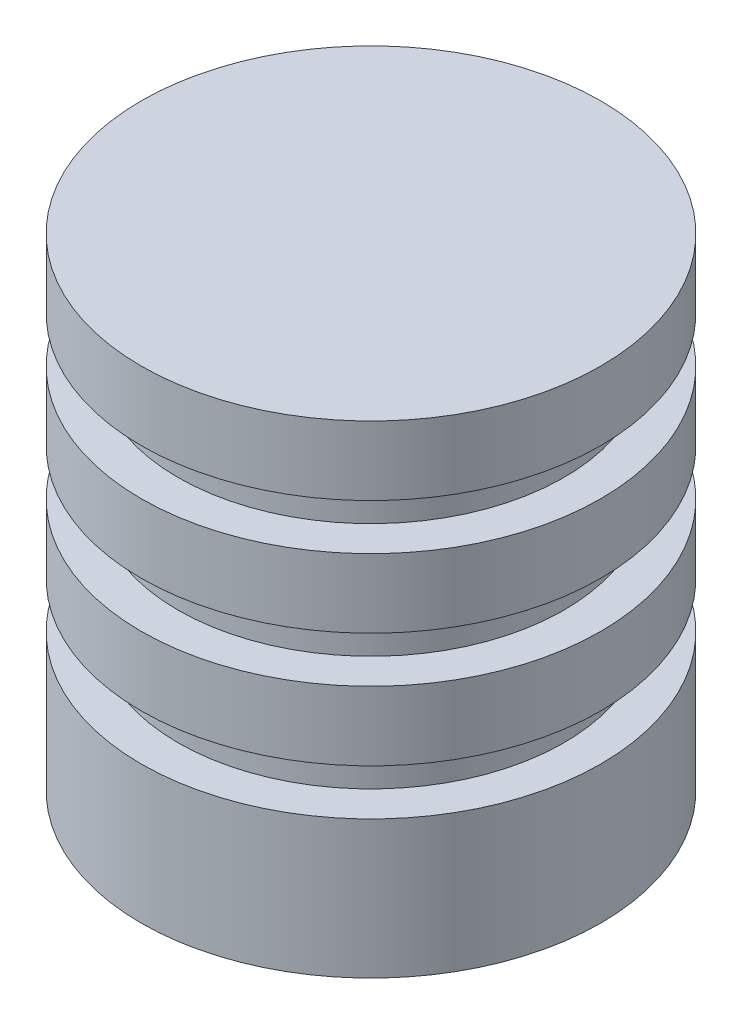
ISO-10303-21;
HEADER;
FILE_DESCRIPTION(('STEP AP214'),'2;1');
FILE_NAME('part.step','',(''),(''),'','','');
FILE_SCHEMA(('AUTOMOTIVE_DESIGN { 1 0 10303 214 1 1 1 1 }'));
ENDSEC;
DATA;
#1=APPLICATION_CONTEXT('core data for automotive mechanical design processes');
#2=APPLICATION_PROTOCOL_DEFINITION('international standard','automotive_design',2000,#1);
#3=PRODUCT_CONTEXT('',#1,'mechanical');
#4=PRODUCT('Part','Part','',(#3));
#5=PRODUCT_RELATED_PRODUCT_CATEGORY('part','',(#4));
#6=PRODUCT_DEFINITION_FORMATION('','',#4);
#7=PRODUCT_DEFINITION_CONTEXT('part definition',#1,'design');
#8=PRODUCT_DEFINITION('design','',#6,#7);
#9=PRODUCT_DEFINITION_SHAPE('','',#8);
#10=(LENGTH_UNIT() NAMED_UNIT(*) SI_UNIT(.MILLI.,.METRE.));
#11=(NAMED_UNIT(*) PLANE_ANGLE_UNIT() SI_UNIT($,.RADIAN.));
#12=(NAMED_UNIT(*) SI_UNIT($,.STERADIAN.) SOLID_ANGLE_UNIT());
#13=UNCERTAINTY_MEASURE_WITH_UNIT(LENGTH_MEASURE(1.E-05),#10,'distance_accuracy_value','');
#14=(GEOMETRIC_REPRESENTATION_CONTEXT(3) GLOBAL_UNCERTAINTY_ASSIGNED_CONTEXT((#13)) GLOBAL_UNIT_ASSIGNED_CONTEXT((#10,
#11,#12)) REPRESENTATION_CONTEXT('',''));
#15=CARTESIAN_POINT('',(0.,0.,0.));
#16=DIRECTION('',(0.,0.,1.));
#17=DIRECTION('',(1.,0.,0.));
#18=AXIS2_PLACEMENT_3D('',#15,#16,#17);
#19=CARTESIAN_POINT('',(0.,0.,0.));
#20=DIRECTION('',(0.,-1.,0.));
#21=DIRECTION('',(0.,0.,-1.));
#22=AXIS2_PLACEMENT_3D('',#19,#20,#21);
#23=CYLINDRICAL_SURFACE('',#22,50.);
#24=CARTESIAN_POINT('',(0.,65.,0.));
#25=DIRECTION('',(0.,1.,0.));
#26=DIRECTION('',(0.,0.,1.));
#27=AXIS2_PLACEMENT_3D('',#24,#25,#26);
#28=CIRCLE('',#27,50.);
#29=CARTESIAN_POINT('',(0.,65.,50.));
#30=VERTEX_POINT('',#29);
#31=EDGE_CURVE('E69',#30,#30,#28,.F.);
#32=ORIENTED_EDGE('',*,*,#31,.F.);
#33=EDGE_LOOP('',(#32));
#34=FACE_BOUND('',#33,.T.);
#35=CARTESIAN_POINT('',(0.,80.,0.));
#36=DIRECTION('',(0.,1.,0.));
#37=DIRECTION('',(0.,0.,1.));
#38=AXIS2_PLACEMENT_3D('',#35,#36,#37);
#39=CIRCLE('',#38,50.);
#40=CARTESIAN_POINT('',(0.,80.,50.));
#41=VERTEX_POINT('',#40);
#42=EDGE_CURVE('E58',#41,#41,#39,.F.);
#43=ORIENTED_EDGE('',*,*,#42,.T.);
#44=EDGE_LOOP('',(#43));
#45=FACE_BOUND('',#44,.T.);
#46=ADVANCED_FACE('F38',(#34,#45),#23,.T.);
#47=CARTESIAN_POINT('',(0.,80.,0.));
#48=DIRECTION('',(0.,1.,0.));
#49=DIRECTION('',(0.,0.,1.));
#50=AXIS2_PLACEMENT_3D('',#47,#48,#49);
#51=PLANE('',#50);
#52=ORIENTED_EDGE('',*,*,#42,.F.);
#53=EDGE_LOOP('',(#52));
#54=FACE_BOUND('',#53,.T.);
#55=CARTESIAN_POINT('',(0.,80.,0.));
#56=DIRECTION('',(0.,1.,0.));
#57=DIRECTION('',(0.,0.,1.));
#58=AXIS2_PLACEMENT_3D('',#55,#56,#57);
#59=CIRCLE('',#58,42.);
#60=CARTESIAN_POINT('',(0.,80.,42.));
#61=VERTEX_POINT('',#60);
#62=EDGE_CURVE('E59',#61,#61,#59,.T.);
#63=ORIENTED_EDGE('',*,*,#62,.F.);
#64=EDGE_LOOP('',(#63));
#65=FACE_BOUND('',#64,.T.);
#66=ADVANCED_FACE('F111',(#54,#65),#51,.T.);
#67=CARTESIAN_POINT('',(0.,90.,0.));
#68=DIRECTION('',(0.,1.,0.));
#69=DIRECTION('',(0.,0.,1.));
#70=AXIS2_PLACEMENT_3D('',#67,#68,#69);
#71=PLANE('',#70);
#72=CARTESIAN_POINT('',(0.,90.,0.));
#73=DIRECTION('',(0.,1.,0.));
#74=DIRECTION('',(0.,0.,1.));
#75=AXIS2_PLACEMENT_3D('',#72,#73,#74);
#76=CIRCLE('',#75,50.);
#77=CARTESIAN_POINT('',(0.,90.,50.));
#78=VERTEX_POINT('',#77);
#79=EDGE_CURVE('E55',#78,#78,#76,.F.);
#80=ORIENTED_EDGE('',*,*,#79,.T.);
#81=EDGE_LOOP('',(#80));
#82=FACE_BOUND('',#81,.T.);
#83=CARTESIAN_POINT('',(0.,90.,0.));
#84=DIRECTION('',(0.,1.,0.));
#85=DIRECTION('',(0.,0.,1.));
#86=AXIS2_PLACEMENT_3D('',#83,#84,#85);
#87=CIRCLE('',#86,42.);
#88=CARTESIAN_POINT('',(0.,90.,42.));
#89=VERTEX_POINT('',#88);
#90=EDGE_CURVE('E74',#89,#89,#87,.T.);
#91=ORIENTED_EDGE('',*,*,#90,.T.);
#92=EDGE_LOOP('',(#91));
#93=FACE_BOUND('',#92,.T.);
#94=ADVANCED_FACE('F119',(#82,#93),#71,.F.);
#95=CARTESIAN_POINT('',(0.,80.,0.));
#96=DIRECTION('',(0.,1.,0.));
#97=DIRECTION('',(0.,0.,1.));
#98=AXIS2_PLACEMENT_3D('',#95,#96,#97);
#99=CYLINDRICAL_SURFACE('',#98,42.);
#100=ORIENTED_EDGE('',*,*,#62,.T.);
#101=EDGE_LOOP('',(#100));
#102=FACE_BOUND('',#101,.T.);
#103=ORIENTED_EDGE('',*,*,#90,.F.);
#104=EDGE_LOOP('',(#103));
#105=FACE_BOUND('',#104,.T.);
#106=ADVANCED_FACE('F133',(#102,#105),#99,.T.);
#107=CARTESIAN_POINT('',(0.,105.,0.));
#108=DIRECTION('',(0.,1.,0.));
#109=DIRECTION('',(0.,0.,1.));
#110=AXIS2_PLACEMENT_3D('',#107,#108,#109);
#111=PLANE('',#110);
#112=CARTESIAN_POINT('',(0.,105.,0.));
#113=DIRECTION('',(0.,-1.,0.));
#114=DIRECTION('',(0.,0.,-1.));
#115=AXIS2_PLACEMENT_3D('',#112,#113,#114);
#116=CIRCLE('',#115,50.);
#117=CARTESIAN_POINT('',(0.,105.,-50.));
#118=VERTEX_POINT('',#117);
#119=EDGE_CURVE('E11',#118,#118,#116,.T.);
#120=ORIENTED_EDGE('',*,*,#119,.F.);
#121=EDGE_LOOP('',(#120));
#122=FACE_BOUND('',#121,.T.);
#123=ADVANCED_FACE('F124',(#122),#111,.T.);
#124=ORIENTED_EDGE('',*,*,#79,.F.);
#125=EDGE_LOOP('',(#124));
#126=FACE_BOUND('',#125,.T.);
#127=ORIENTED_EDGE('',*,*,#119,.T.);
#128=EDGE_LOOP('',(#127));
#129=FACE_BOUND('',#128,.T.);
#130=ADVANCED_FACE('F113',(#126,#129),#23,.T.);
#131=CARTESIAN_POINT('',(0.,55.,0.));
#132=DIRECTION('',(0.,1.,0.));
#133=DIRECTION('',(0.,0.,1.));
#134=AXIS2_PLACEMENT_3D('',#131,#132,#133);
#135=PLANE('',#134);
#136=CARTESIAN_POINT('',(0.,55.,0.));
#137=DIRECTION('',(0.,1.,0.));
#138=DIRECTION('',(0.,0.,1.));
#139=AXIS2_PLACEMENT_3D('',#136,#137,#138);
#140=CIRCLE('',#139,50.);
#141=CARTESIAN_POINT('',(0.,55.,50.));
#142=VERTEX_POINT('',#141);
#143=EDGE_CURVE('E42',#142,#142,#140,.F.);
#144=ORIENTED_EDGE('',*,*,#143,.F.);
#145=EDGE_LOOP('',(#144));
#146=FACE_BOUND('',#145,.T.);
#147=CARTESIAN_POINT('',(0.,55.,0.));
#148=DIRECTION('',(0.,1.,0.));
#149=DIRECTION('',(0.,0.,1.));
#150=AXIS2_PLACEMENT_3D('',#147,#148,#149);
#151=CIRCLE('',#150,42.);
#152=CARTESIAN_POINT('',(0.,55.,42.));
#153=VERTEX_POINT('',#152);
#154=EDGE_CURVE('E67',#153,#153,#151,.T.);
#155=ORIENTED_EDGE('',*,*,#154,.F.);
#156=EDGE_LOOP('',(#155));
#157=FACE_BOUND('',#156,.T.);
#158=ADVANCED_FACE('F123',(#146,#157),#135,.T.);
#159=CARTESIAN_POINT('',(0.,65.,0.));
#160=DIRECTION('',(0.,1.,0.));
#161=DIRECTION('',(0.,0.,1.));
#162=AXIS2_PLACEMENT_3D('',#159,#160,#161);
#163=PLANE('',#162);
#164=ORIENTED_EDGE('',*,*,#31,.T.);
#165=EDGE_LOOP('',(#164));
#166=FACE_BOUND('',#165,.T.);
#167=CARTESIAN_POINT('',(0.,65.,0.));
#168=DIRECTION('',(0.,1.,0.));
#169=DIRECTION('',(0.,0.,1.));
#170=AXIS2_PLACEMENT_3D('',#167,#168,#169);
#171=CIRCLE('',#170,42.);
#172=CARTESIAN_POINT('',(0.,65.,42.));
#173=VERTEX_POINT('',#172);
#174=EDGE_CURVE('E163',#173,#173,#171,.T.);
#175=ORIENTED_EDGE('',*,*,#174,.T.);
#176=EDGE_LOOP('',(#175));
#177=FACE_BOUND('',#176,.T.);
#178=ADVANCED_FACE('F129',(#166,#177),#163,.F.);
#179=CARTESIAN_POINT('',(0.,55.,0.));
#180=DIRECTION('',(0.,1.,0.));
#181=DIRECTION('',(0.,0.,1.));
#182=AXIS2_PLACEMENT_3D('',#179,#180,#181);
#183=CYLINDRICAL_SURFACE('',#182,42.);
#184=ORIENTED_EDGE('',*,*,#154,.T.);
#185=EDGE_LOOP('',(#184));
#186=FACE_BOUND('',#185,.T.);
#187=ORIENTED_EDGE('',*,*,#174,.F.);
#188=EDGE_LOOP('',(#187));
#189=FACE_BOUND('',#188,.T.);
#190=ADVANCED_FACE('F138',(#186,#189),#183,.T.);
#191=CARTESIAN_POINT('',(0.,40.,0.));
#192=DIRECTION('',(0.,1.,0.));
#193=DIRECTION('',(0.,0.,1.));
#194=AXIS2_PLACEMENT_3D('',#191,#192,#193);
#195=CIRCLE('',#194,50.);
#196=CARTESIAN_POINT('',(0.,40.,50.));
#197=VERTEX_POINT('',#196);
#198=EDGE_CURVE('E63',#197,#197,#195,.F.);
#199=ORIENTED_EDGE('',*,*,#198,.F.);
#200=EDGE_LOOP('',(#199));
#201=FACE_BOUND('',#200,.T.);
#202=ORIENTED_EDGE('',*,*,#143,.T.);
#203=EDGE_LOOP('',(#202));
#204=FACE_BOUND('',#203,.T.);
#205=ADVANCED_FACE('F107',(#201,#204),#23,.T.);
#206=CARTESIAN_POINT('',(0.,30.,0.));
#207=DIRECTION('',(0.,1.,0.));
#208=DIRECTION('',(0.,0.,1.));
#209=AXIS2_PLACEMENT_3D('',#206,#207,#208);
#210=PLANE('',#209);
#211=CARTESIAN_POINT('',(0.,30.,0.));
#212=DIRECTION('',(0.,1.,0.));
#213=DIRECTION('',(0.,0.,1.));
#214=AXIS2_PLACEMENT_3D('',#211,#212,#213);
#215=CIRCLE('',#214,50.);
#216=CARTESIAN_POINT('',(0.,30.,50.));
#217=VERTEX_POINT('',#216);
#218=EDGE_CURVE('E66',#217,#217,#215,.F.);
#219=ORIENTED_EDGE('',*,*,#218,.F.);
#220=EDGE_LOOP('',(#219));
#221=FACE_BOUND('',#220,.T.);
#222=CARTESIAN_POINT('',(0.,30.,0.));
#223=DIRECTION('',(0.,1.,0.));
#224=DIRECTION('',(0.,0.,1.));
#225=AXIS2_PLACEMENT_3D('',#222,#223,#224);
#226=CIRCLE('',#225,42.);
#227=CARTESIAN_POINT('',(0.,30.,42.));
#228=VERTEX_POINT('',#227);
#229=EDGE_CURVE('E161',#228,#228,#226,.T.);
#230=ORIENTED_EDGE('',*,*,#229,.F.);
#231=EDGE_LOOP('',(#230));
#232=FACE_BOUND('',#231,.T.);
#233=ADVANCED_FACE('F137',(#221,#232),#210,.T.);
#234=CARTESIAN_POINT('',(0.,40.,0.));
#235=DIRECTION('',(0.,1.,0.));
#236=DIRECTION('',(0.,0.,1.));
#237=AXIS2_PLACEMENT_3D('',#234,#235,#236);
#238=PLANE('',#237);
#239=ORIENTED_EDGE('',*,*,#198,.T.);
#240=EDGE_LOOP('',(#239));
#241=FACE_BOUND('',#240,.T.);
#242=CARTESIAN_POINT('',(0.,40.,0.));
#243=DIRECTION('',(0.,1.,0.));
#244=DIRECTION('',(0.,0.,1.));
#245=AXIS2_PLACEMENT_3D('',#242,#243,#244);
#246=CIRCLE('',#245,42.);
#247=CARTESIAN_POINT('',(0.,40.,42.));
#248=VERTEX_POINT('',#247);
#249=EDGE_CURVE('E159',#248,#248,#246,.T.);
#250=ORIENTED_EDGE('',*,*,#249,.T.);
#251=EDGE_LOOP('',(#250));
#252=FACE_BOUND('',#251,.T.);
#253=ADVANCED_FACE('F145',(#241,#252),#238,.F.);
#254=CARTESIAN_POINT('',(0.,30.,0.));
#255=DIRECTION('',(0.,1.,0.));
#256=DIRECTION('',(0.,0.,1.));
#257=AXIS2_PLACEMENT_3D('',#254,#255,#256);
#258=CYLINDRICAL_SURFACE('',#257,42.);
#259=ORIENTED_EDGE('',*,*,#229,.T.);
#260=EDGE_LOOP('',(#259));
#261=FACE_BOUND('',#260,.T.);
#262=ORIENTED_EDGE('',*,*,#249,.F.);
#263=EDGE_LOOP('',(#262));
#264=FACE_BOUND('',#263,.T.);
#265=ADVANCED_FACE('F155',(#261,#264),#258,.T.);
#266=CARTESIAN_POINT('',(14.7927405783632,95.,0.));
#267=DIRECTION('',(0.,-1.,0.));
#268=DIRECTION('',(0.,0.,-1.));
#269=AXIS2_PLACEMENT_3D('',#266,#267,#268);
#270=PLANE('',#269);
#271=CARTESIAN_POINT('',(0.,95.,0.));
#272=DIRECTION('',(0.,-1.,0.));
#273=DIRECTION('',(0.,0.,-1.));
#274=AXIS2_PLACEMENT_3D('',#271,#272,#273);
#275=CIRCLE('',#274,14.7927405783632);
#276=CARTESIAN_POINT('',(0.,95.,-14.7927405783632));
#277=VERTEX_POINT('',#276);
#278=EDGE_CURVE('E62',#277,#277,#275,.T.);
#279=ORIENTED_EDGE('',*,*,#278,.T.);
#280=EDGE_LOOP('',(#279));
#281=FACE_BOUND('',#280,.T.);
#282=ADVANCED_FACE('F40',(#281),#270,.T.);
#283=CARTESIAN_POINT('',(0.,95.,0.));
#284=DIRECTION('',(0.,-1.,0.));
#285=DIRECTION('',(0.,0.,-1.));
#286=AXIS2_PLACEMENT_3D('',#283,#284,#285);
#287=CONICAL_SURFACE('',#286,14.7927405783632,0.523598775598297);
#288=CARTESIAN_POINT('',(0.,60.,0.));
#289=DIRECTION('',(0.,-1.,0.));
#290=DIRECTION('',(0.,0.,-1.));
#291=AXIS2_PLACEMENT_3D('',#288,#289,#290);
#292=CIRCLE('',#291,35.);
#293=CARTESIAN_POINT('',(0.,60.,-35.));
#294=VERTEX_POINT('',#293);
#295=EDGE_CURVE('E87',#294,#294,#292,.T.);
#296=ORIENTED_EDGE('',*,*,#295,.T.);
#297=EDGE_LOOP('',(#296));
#298=FACE_BOUND('',#297,.T.);
#299=ORIENTED_EDGE('',*,*,#278,.F.);
#300=EDGE_LOOP('',(#299));
#301=FACE_BOUND('',#300,.T.);
#302=ADVANCED_FACE('F108',(#298,#301),#287,.F.);
#303=CARTESIAN_POINT('',(0.,0.,0.));
#304=DIRECTION('',(0.,-1.,0.));
#305=DIRECTION('',(0.,0.,-1.));
#306=AXIS2_PLACEMENT_3D('',#303,#304,#305);
#307=CYLINDRICAL_SURFACE('',#306,35.);
#308=CARTESIAN_POINT('',(0.,0.,0.));
#309=DIRECTION('',(0.,-1.,0.));
#310=DIRECTION('',(0.,0.,-1.));
#311=AXIS2_PLACEMENT_3D('',#308,#309,#310);
#312=CIRCLE('',#311,35.);
#313=CARTESIAN_POINT('',(0.,0.,-35.));
#314=VERTEX_POINT('',#313);
#315=EDGE_CURVE('E51',#314,#314,#312,.T.);
#316=ORIENTED_EDGE('',*,*,#315,.T.);
#317=EDGE_LOOP('',(#316));
#318=FACE_BOUND('',#317,.T.);
#319=ORIENTED_EDGE('',*,*,#295,.F.);
#320=EDGE_LOOP('',(#319));
#321=FACE_BOUND('',#320,.T.);
#322=ADVANCED_FACE('F92',(#318,#321),#307,.F.);
#323=CARTESIAN_POINT('',(50.,0.,0.));
#324=DIRECTION('',(0.,-1.,0.));
#325=DIRECTION('',(0.,0.,-1.));
#326=AXIS2_PLACEMENT_3D('',#323,#324,#325);
#327=PLANE('',#326);
#328=CARTESIAN_POINT('',(0.,0.,0.));
#329=DIRECTION('',(0.,-1.,0.));
#330=DIRECTION('',(0.,0.,-1.));
#331=AXIS2_PLACEMENT_3D('',#328,#329,#330);
#332=CIRCLE('',#331,50.);
#333=CARTESIAN_POINT('',(0.,0.,-50.));
#334=VERTEX_POINT('',#333);
#335=EDGE_CURVE('E46',#334,#334,#332,.T.);
#336=ORIENTED_EDGE('',*,*,#335,.T.);
#337=EDGE_LOOP('',(#336));
#338=FACE_BOUND('',#337,.T.);
#339=ORIENTED_EDGE('',*,*,#315,.F.);
#340=EDGE_LOOP('',(#339));
#341=FACE_BOUND('',#340,.T.);
#342=ADVANCED_FACE('F95',(#338,#341),#327,.T.);
#343=ORIENTED_EDGE('',*,*,#335,.F.);
#344=EDGE_LOOP('',(#343));
#345=FACE_BOUND('',#344,.T.);
#346=ORIENTED_EDGE('',*,*,#218,.T.);
#347=EDGE_LOOP('',(#346));
#348=FACE_BOUND('',#347,.T.);
#349=ADVANCED_FACE('F97',(#345,#348),#23,.T.);
#350=CLOSED_SHELL('',(#46,#66,#94,#106,#123,#130,#158,#178,#190,#205,#233,#253,#265,#282,#302,
#322,#342,#349));
#351=MANIFOLD_SOLID_BREP('B2',#350);
#352=ADVANCED_BREP_SHAPE_REPRESENTATION('',(#18,#351),#14);
#353=SHAPE_DEFINITION_REPRESENTATION(#9,#352);
ENDSEC;
END-ISO-10303-21;
